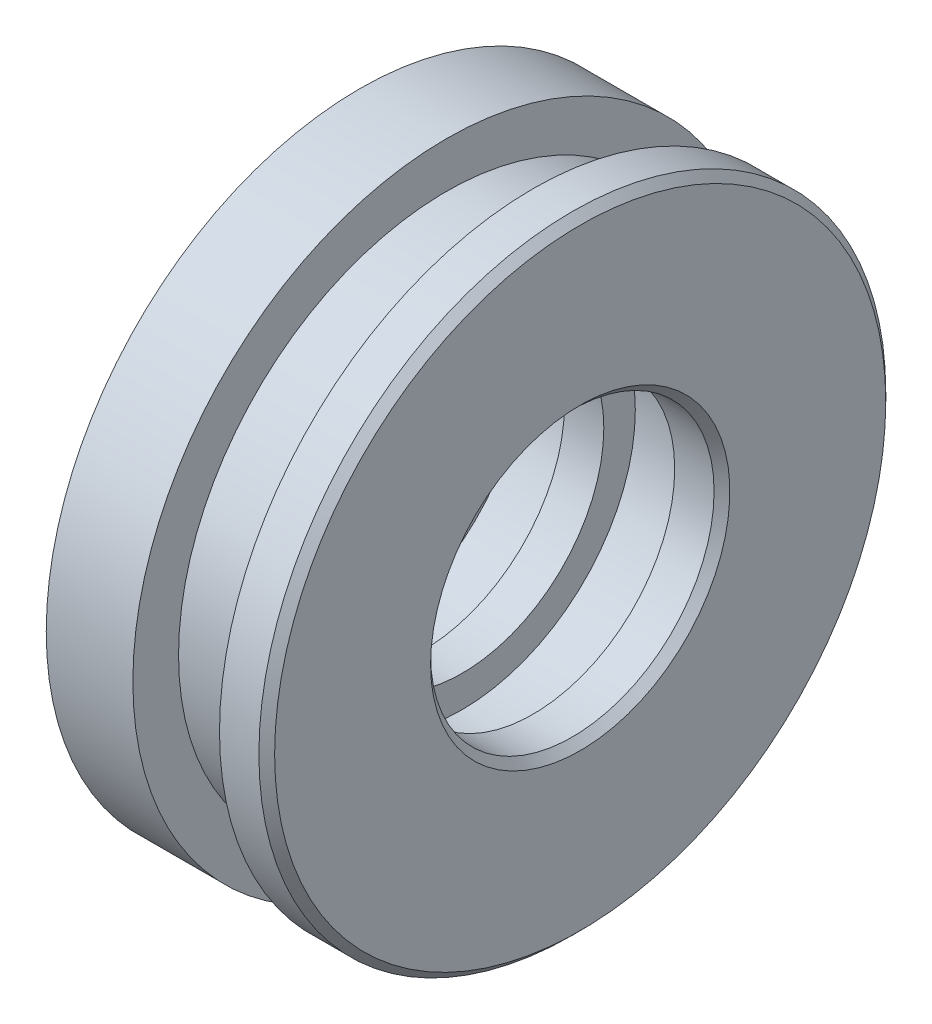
ISO-10303-21;
HEADER;
FILE_DESCRIPTION(('STEP AP214'),'2;1');
FILE_NAME('part.step','',(''),(''),'','','');
FILE_SCHEMA(('AUTOMOTIVE_DESIGN { 1 0 10303 214 1 1 1 1 }'));
ENDSEC;
DATA;
#1=APPLICATION_CONTEXT('core data for automotive mechanical design processes');
#2=APPLICATION_PROTOCOL_DEFINITION('international standard','automotive_design',2000,#1);
#3=PRODUCT_CONTEXT('',#1,'mechanical');
#4=PRODUCT('Part','Part','',(#3));
#5=PRODUCT_RELATED_PRODUCT_CATEGORY('part','',(#4));
#6=PRODUCT_DEFINITION_FORMATION('','',#4);
#7=PRODUCT_DEFINITION_CONTEXT('part definition',#1,'design');
#8=PRODUCT_DEFINITION('design','',#6,#7);
#9=PRODUCT_DEFINITION_SHAPE('','',#8);
#10=(LENGTH_UNIT() NAMED_UNIT(*) SI_UNIT(.MILLI.,.METRE.));
#11=(NAMED_UNIT(*) PLANE_ANGLE_UNIT() SI_UNIT($,.RADIAN.));
#12=(NAMED_UNIT(*) SI_UNIT($,.STERADIAN.) SOLID_ANGLE_UNIT());
#13=UNCERTAINTY_MEASURE_WITH_UNIT(LENGTH_MEASURE(1.E-05),#10,'distance_accuracy_value','');
#14=(GEOMETRIC_REPRESENTATION_CONTEXT(3) GLOBAL_UNCERTAINTY_ASSIGNED_CONTEXT((#13)) GLOBAL_UNIT_ASSIGNED_CONTEXT((#10,
#11,#12)) REPRESENTATION_CONTEXT('',''));
#15=CARTESIAN_POINT('',(0.,0.,0.));
#16=DIRECTION('',(0.,0.,1.));
#17=DIRECTION('',(1.,0.,0.));
#18=AXIS2_PLACEMENT_3D('',#15,#16,#17);
#19=CARTESIAN_POINT('',(0.,0.,0.));
#20=DIRECTION('',(-1.,0.,0.));
#21=DIRECTION('',(0.,0.,1.));
#22=AXIS2_PLACEMENT_3D('',#19,#20,#21);
#23=CYLINDRICAL_SURFACE('',#22,13.);
#24=CARTESIAN_POINT('',(0.,0.,0.));
#25=DIRECTION('',(-1.,0.,0.));
#26=DIRECTION('',(0.,0.,1.));
#27=AXIS2_PLACEMENT_3D('',#24,#25,#26);
#28=CIRCLE('',#27,13.);
#29=CARTESIAN_POINT('',(0.,0.,13.));
#30=VERTEX_POINT('',#29);
#31=EDGE_CURVE('E10',#30,#30,#28,.T.);
#32=ORIENTED_EDGE('',*,*,#31,.F.);
#33=EDGE_LOOP('',(#32));
#34=FACE_BOUND('',#33,.T.);
#35=CARTESIAN_POINT('',(4.,0.,0.));
#36=DIRECTION('',(-1.,0.,0.));
#37=DIRECTION('',(0.,0.,1.));
#38=AXIS2_PLACEMENT_3D('',#35,#36,#37);
#39=CIRCLE('',#38,13.);
#40=CARTESIAN_POINT('',(4.,0.,13.));
#41=VERTEX_POINT('',#40);
#42=EDGE_CURVE('E94',#41,#41,#39,.T.);
#43=ORIENTED_EDGE('',*,*,#42,.T.);
#44=EDGE_LOOP('',(#43));
#45=FACE_BOUND('',#44,.T.);
#46=ADVANCED_FACE('F30',(#34,#45),#23,.T.);
#47=CARTESIAN_POINT('',(0.,8.99999999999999,0.));
#48=DIRECTION('',(1.,0.,0.));
#49=DIRECTION('',(0.,0.,-1.));
#50=AXIS2_PLACEMENT_3D('',#47,#48,#49);
#51=PLANE('',#50);
#52=CARTESIAN_POINT('',(0.,0.,0.));
#53=DIRECTION('',(-1.,0.,0.));
#54=DIRECTION('',(0.,0.,1.));
#55=AXIS2_PLACEMENT_3D('',#52,#53,#54);
#56=CIRCLE('',#55,9.);
#57=CARTESIAN_POINT('',(0.,0.,8.99999999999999));
#58=VERTEX_POINT('',#57);
#59=EDGE_CURVE('E36',#58,#58,#56,.T.);
#60=ORIENTED_EDGE('',*,*,#59,.F.);
#61=EDGE_LOOP('',(#60));
#62=FACE_BOUND('',#61,.T.);
#63=ORIENTED_EDGE('',*,*,#31,.T.);
#64=EDGE_LOOP('',(#63));
#65=FACE_BOUND('',#64,.T.);
#66=ADVANCED_FACE('F203',(#62,#65),#51,.F.);
#67=CARTESIAN_POINT('',(0.,0.,0.));
#68=DIRECTION('',(-1.,0.,0.));
#69=DIRECTION('',(0.,0.,1.));
#70=AXIS2_PLACEMENT_3D('',#67,#68,#69);
#71=CYLINDRICAL_SURFACE('',#70,9.);
#72=CARTESIAN_POINT('',(4.,0.,0.));
#73=DIRECTION('',(-1.,0.,0.));
#74=DIRECTION('',(0.,0.,1.));
#75=AXIS2_PLACEMENT_3D('',#72,#73,#74);
#76=CIRCLE('',#75,9.);
#77=CARTESIAN_POINT('',(4.,0.,8.99999999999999));
#78=VERTEX_POINT('',#77);
#79=EDGE_CURVE('E40',#78,#78,#76,.T.);
#80=ORIENTED_EDGE('',*,*,#79,.F.);
#81=EDGE_LOOP('',(#80));
#82=FACE_BOUND('',#81,.T.);
#83=ORIENTED_EDGE('',*,*,#59,.T.);
#84=EDGE_LOOP('',(#83));
#85=FACE_BOUND('',#84,.T.);
#86=ADVANCED_FACE('F198',(#82,#85),#71,.F.);
#87=CARTESIAN_POINT('',(4.,10.5,0.));
#88=DIRECTION('',(-1.,0.,0.));
#89=DIRECTION('',(0.,0.,1.));
#90=AXIS2_PLACEMENT_3D('',#87,#88,#89);
#91=PLANE('',#90);
#92=CARTESIAN_POINT('',(4.,0.,0.));
#93=DIRECTION('',(-1.,0.,0.));
#94=DIRECTION('',(0.,0.,1.));
#95=AXIS2_PLACEMENT_3D('',#92,#93,#94);
#96=CIRCLE('',#95,10.5);
#97=CARTESIAN_POINT('',(4.,0.,10.5));
#98=VERTEX_POINT('',#97);
#99=EDGE_CURVE('E44',#98,#98,#96,.T.);
#100=ORIENTED_EDGE('',*,*,#99,.F.);
#101=EDGE_LOOP('',(#100));
#102=FACE_BOUND('',#101,.T.);
#103=ORIENTED_EDGE('',*,*,#79,.T.);
#104=EDGE_LOOP('',(#103));
#105=FACE_BOUND('',#104,.T.);
#106=ADVANCED_FACE('F192',(#102,#105),#91,.F.);
#107=CARTESIAN_POINT('',(0.,0.,0.));
#108=DIRECTION('',(-1.,0.,0.));
#109=DIRECTION('',(0.,0.,1.));
#110=AXIS2_PLACEMENT_3D('',#107,#108,#109);
#111=CYLINDRICAL_SURFACE('',#110,10.5);
#112=CARTESIAN_POINT('',(8.,0.,0.));
#113=DIRECTION('',(-1.,0.,0.));
#114=DIRECTION('',(0.,0.,1.));
#115=AXIS2_PLACEMENT_3D('',#112,#113,#114);
#116=CIRCLE('',#115,10.5);
#117=CARTESIAN_POINT('',(8.,0.,10.5));
#118=VERTEX_POINT('',#117);
#119=EDGE_CURVE('E49',#118,#118,#116,.T.);
#120=ORIENTED_EDGE('',*,*,#119,.F.);
#121=EDGE_LOOP('',(#120));
#122=FACE_BOUND('',#121,.T.);
#123=ORIENTED_EDGE('',*,*,#99,.T.);
#124=EDGE_LOOP('',(#123));
#125=FACE_BOUND('',#124,.T.);
#126=ADVANCED_FACE('F186',(#122,#125),#111,.F.);
#127=CARTESIAN_POINT('',(8.,8.99999999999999,0.));
#128=DIRECTION('',(1.,0.,0.));
#129=DIRECTION('',(0.,0.,-1.));
#130=AXIS2_PLACEMENT_3D('',#127,#128,#129);
#131=PLANE('',#130);
#132=CARTESIAN_POINT('',(8.,0.,0.));
#133=DIRECTION('',(-1.,0.,0.));
#134=DIRECTION('',(0.,0.,1.));
#135=AXIS2_PLACEMENT_3D('',#132,#133,#134);
#136=CIRCLE('',#135,9.);
#137=CARTESIAN_POINT('',(8.,0.,9.));
#138=VERTEX_POINT('',#137);
#139=EDGE_CURVE('E52',#138,#138,#136,.T.);
#140=ORIENTED_EDGE('',*,*,#139,.F.);
#141=EDGE_LOOP('',(#140));
#142=FACE_BOUND('',#141,.T.);
#143=ORIENTED_EDGE('',*,*,#119,.T.);
#144=EDGE_LOOP('',(#143));
#145=FACE_BOUND('',#144,.T.);
#146=ADVANCED_FACE('F180',(#142,#145),#131,.F.);
#147=CARTESIAN_POINT('',(0.,0.,0.));
#148=DIRECTION('',(-1.,0.,0.));
#149=DIRECTION('',(0.,0.,1.));
#150=AXIS2_PLACEMENT_3D('',#147,#148,#149);
#151=CYLINDRICAL_SURFACE('',#150,9.);
#152=CARTESIAN_POINT('',(10.5,0.,0.));
#153=DIRECTION('',(-1.,0.,0.));
#154=DIRECTION('',(0.,0.,1.));
#155=AXIS2_PLACEMENT_3D('',#152,#153,#154);
#156=CIRCLE('',#155,9.);
#157=CARTESIAN_POINT('',(10.5,0.,9.));
#158=VERTEX_POINT('',#157);
#159=EDGE_CURVE('E55',#158,#158,#156,.T.);
#160=ORIENTED_EDGE('',*,*,#159,.F.);
#161=EDGE_LOOP('',(#160));
#162=FACE_BOUND('',#161,.T.);
#163=ORIENTED_EDGE('',*,*,#139,.T.);
#164=EDGE_LOOP('',(#163));
#165=FACE_BOUND('',#164,.T.);
#166=ADVANCED_FACE('F174',(#162,#165),#151,.F.);
#167=CARTESIAN_POINT('',(10.5,11.,0.));
#168=DIRECTION('',(-1.,0.,0.));
#169=DIRECTION('',(0.,0.,1.));
#170=AXIS2_PLACEMENT_3D('',#167,#168,#169);
#171=PLANE('',#170);
#172=CARTESIAN_POINT('',(10.5,0.,0.));
#173=DIRECTION('',(-1.,0.,0.));
#174=DIRECTION('',(0.,0.,1.));
#175=AXIS2_PLACEMENT_3D('',#172,#173,#174);
#176=CIRCLE('',#175,11.);
#177=CARTESIAN_POINT('',(10.5,0.,11.));
#178=VERTEX_POINT('',#177);
#179=EDGE_CURVE('E58',#178,#178,#176,.T.);
#180=ORIENTED_EDGE('',*,*,#179,.F.);
#181=EDGE_LOOP('',(#180));
#182=FACE_BOUND('',#181,.T.);
#183=ORIENTED_EDGE('',*,*,#159,.T.);
#184=EDGE_LOOP('',(#183));
#185=FACE_BOUND('',#184,.T.);
#186=ADVANCED_FACE('F168',(#182,#185),#171,.F.);
#187=CARTESIAN_POINT('',(0.,0.,0.));
#188=DIRECTION('',(-1.,0.,0.));
#189=DIRECTION('',(0.,0.,1.));
#190=AXIS2_PLACEMENT_3D('',#187,#188,#189);
#191=CYLINDRICAL_SURFACE('',#190,11.);
#192=CARTESIAN_POINT('',(15.,0.,0.));
#193=DIRECTION('',(-1.,0.,0.));
#194=DIRECTION('',(0.,0.,1.));
#195=AXIS2_PLACEMENT_3D('',#192,#193,#194);
#196=CIRCLE('',#195,11.);
#197=CARTESIAN_POINT('',(15.,0.,11.));
#198=VERTEX_POINT('',#197);
#199=EDGE_CURVE('E61',#198,#198,#196,.T.);
#200=ORIENTED_EDGE('',*,*,#199,.F.);
#201=EDGE_LOOP('',(#200));
#202=FACE_BOUND('',#201,.T.);
#203=ORIENTED_EDGE('',*,*,#179,.T.);
#204=EDGE_LOOP('',(#203));
#205=FACE_BOUND('',#204,.T.);
#206=ADVANCED_FACE('F162',(#202,#205),#191,.F.);
#207=CARTESIAN_POINT('',(15.,9.,0.));
#208=DIRECTION('',(1.,0.,0.));
#209=DIRECTION('',(0.,0.,-1.));
#210=AXIS2_PLACEMENT_3D('',#207,#208,#209);
#211=PLANE('',#210);
#212=CARTESIAN_POINT('',(15.,0.,0.));
#213=DIRECTION('',(-1.,0.,0.));
#214=DIRECTION('',(0.,0.,1.));
#215=AXIS2_PLACEMENT_3D('',#212,#213,#214);
#216=CIRCLE('',#215,9.);
#217=CARTESIAN_POINT('',(15.,0.,9.));
#218=VERTEX_POINT('',#217);
#219=EDGE_CURVE('E64',#218,#218,#216,.T.);
#220=ORIENTED_EDGE('',*,*,#219,.F.);
#221=EDGE_LOOP('',(#220));
#222=FACE_BOUND('',#221,.T.);
#223=ORIENTED_EDGE('',*,*,#199,.T.);
#224=EDGE_LOOP('',(#223));
#225=FACE_BOUND('',#224,.T.);
#226=ADVANCED_FACE('F156',(#222,#225),#211,.F.);
#227=CARTESIAN_POINT('',(0.,0.,0.));
#228=DIRECTION('',(-1.,0.,0.));
#229=DIRECTION('',(0.,0.,1.));
#230=AXIS2_PLACEMENT_3D('',#227,#228,#229);
#231=CYLINDRICAL_SURFACE('',#230,9.);
#232=CARTESIAN_POINT('',(17.5,0.,0.));
#233=DIRECTION('',(-1.,0.,0.));
#234=DIRECTION('',(0.,0.,1.));
#235=AXIS2_PLACEMENT_3D('',#232,#233,#234);
#236=CIRCLE('',#235,9.);
#237=CARTESIAN_POINT('',(17.5,0.,9.));
#238=VERTEX_POINT('',#237);
#239=EDGE_CURVE('E67',#238,#238,#236,.T.);
#240=ORIENTED_EDGE('',*,*,#239,.F.);
#241=EDGE_LOOP('',(#240));
#242=FACE_BOUND('',#241,.T.);
#243=ORIENTED_EDGE('',*,*,#219,.T.);
#244=EDGE_LOOP('',(#243));
#245=FACE_BOUND('',#244,.T.);
#246=ADVANCED_FACE('F150',(#242,#245),#231,.F.);
#247=CARTESIAN_POINT('',(17.5,0.,0.));
#248=DIRECTION('',(1.,0.,0.));
#249=DIRECTION('',(0.,0.,-1.));
#250=AXIS2_PLACEMENT_3D('',#247,#248,#249);
#251=CONICAL_SURFACE('',#250,9.,0.785398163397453);
#252=CARTESIAN_POINT('',(18.,0.,0.));
#253=DIRECTION('',(-1.,0.,0.));
#254=DIRECTION('',(0.,0.,1.));
#255=AXIS2_PLACEMENT_3D('',#252,#253,#254);
#256=CIRCLE('',#255,9.5);
#257=CARTESIAN_POINT('',(18.,0.,9.5));
#258=VERTEX_POINT('',#257);
#259=EDGE_CURVE('E70',#258,#258,#256,.T.);
#260=ORIENTED_EDGE('',*,*,#259,.F.);
#261=EDGE_LOOP('',(#260));
#262=FACE_BOUND('',#261,.T.);
#263=ORIENTED_EDGE('',*,*,#239,.T.);
#264=EDGE_LOOP('',(#263));
#265=FACE_BOUND('',#264,.T.);
#266=ADVANCED_FACE('F144',(#262,#265),#251,.F.);
#267=CARTESIAN_POINT('',(18.,19.4,0.));
#268=DIRECTION('',(-1.,0.,0.));
#269=DIRECTION('',(0.,0.,1.));
#270=AXIS2_PLACEMENT_3D('',#267,#268,#269);
#271=PLANE('',#270);
#272=CARTESIAN_POINT('',(18.,0.,0.));
#273=DIRECTION('',(-1.,0.,0.));
#274=DIRECTION('',(0.,0.,1.));
#275=AXIS2_PLACEMENT_3D('',#272,#273,#274);
#276=CIRCLE('',#275,19.4);
#277=CARTESIAN_POINT('',(18.,0.,19.4));
#278=VERTEX_POINT('',#277);
#279=EDGE_CURVE('E73',#278,#278,#276,.T.);
#280=ORIENTED_EDGE('',*,*,#279,.F.);
#281=EDGE_LOOP('',(#280));
#282=FACE_BOUND('',#281,.T.);
#283=ORIENTED_EDGE('',*,*,#259,.T.);
#284=EDGE_LOOP('',(#283));
#285=FACE_BOUND('',#284,.T.);
#286=ADVANCED_FACE('F138',(#282,#285),#271,.F.);
#287=CARTESIAN_POINT('',(18.,0.,0.));
#288=DIRECTION('',(-1.,0.,0.));
#289=DIRECTION('',(0.,0.,1.));
#290=AXIS2_PLACEMENT_3D('',#287,#288,#289);
#291=CONICAL_SURFACE('',#290,19.4,0.785398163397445);
#292=CARTESIAN_POINT('',(17.5,0.,0.));
#293=DIRECTION('',(-1.,0.,0.));
#294=DIRECTION('',(0.,0.,1.));
#295=AXIS2_PLACEMENT_3D('',#292,#293,#294);
#296=CIRCLE('',#295,19.9);
#297=CARTESIAN_POINT('',(17.5,0.,19.9));
#298=VERTEX_POINT('',#297);
#299=EDGE_CURVE('E76',#298,#298,#296,.T.);
#300=ORIENTED_EDGE('',*,*,#299,.F.);
#301=EDGE_LOOP('',(#300));
#302=FACE_BOUND('',#301,.T.);
#303=ORIENTED_EDGE('',*,*,#279,.T.);
#304=EDGE_LOOP('',(#303));
#305=FACE_BOUND('',#304,.T.);
#306=ADVANCED_FACE('F132',(#302,#305),#291,.T.);
#307=CARTESIAN_POINT('',(0.,0.,0.));
#308=DIRECTION('',(-1.,0.,0.));
#309=DIRECTION('',(0.,0.,1.));
#310=AXIS2_PLACEMENT_3D('',#307,#308,#309);
#311=CYLINDRICAL_SURFACE('',#310,19.9);
#312=CARTESIAN_POINT('',(15.,0.,0.));
#313=DIRECTION('',(-1.,0.,0.));
#314=DIRECTION('',(0.,0.,1.));
#315=AXIS2_PLACEMENT_3D('',#312,#313,#314);
#316=CIRCLE('',#315,19.9);
#317=CARTESIAN_POINT('',(15.,0.,19.9));
#318=VERTEX_POINT('',#317);
#319=EDGE_CURVE('E79',#318,#318,#316,.T.);
#320=ORIENTED_EDGE('',*,*,#319,.F.);
#321=EDGE_LOOP('',(#320));
#322=FACE_BOUND('',#321,.T.);
#323=ORIENTED_EDGE('',*,*,#299,.T.);
#324=EDGE_LOOP('',(#323));
#325=FACE_BOUND('',#324,.T.);
#326=ADVANCED_FACE('F126',(#322,#325),#311,.T.);
#327=CARTESIAN_POINT('',(15.,17.,0.));
#328=DIRECTION('',(1.,0.,0.));
#329=DIRECTION('',(0.,0.,-1.));
#330=AXIS2_PLACEMENT_3D('',#327,#328,#329);
#331=PLANE('',#330);
#332=CARTESIAN_POINT('',(15.,0.,0.));
#333=DIRECTION('',(-1.,0.,0.));
#334=DIRECTION('',(0.,0.,1.));
#335=AXIS2_PLACEMENT_3D('',#332,#333,#334);
#336=CIRCLE('',#335,17.);
#337=CARTESIAN_POINT('',(15.,0.,17.));
#338=VERTEX_POINT('',#337);
#339=EDGE_CURVE('E82',#338,#338,#336,.T.);
#340=ORIENTED_EDGE('',*,*,#339,.F.);
#341=EDGE_LOOP('',(#340));
#342=FACE_BOUND('',#341,.T.);
#343=ORIENTED_EDGE('',*,*,#319,.T.);
#344=EDGE_LOOP('',(#343));
#345=FACE_BOUND('',#344,.T.);
#346=ADVANCED_FACE('F120',(#342,#345),#331,.F.);
#347=CARTESIAN_POINT('',(0.,0.,0.));
#348=DIRECTION('',(-1.,0.,0.));
#349=DIRECTION('',(0.,0.,1.));
#350=AXIS2_PLACEMENT_3D('',#347,#348,#349);
#351=CYLINDRICAL_SURFACE('',#350,17.);
#352=CARTESIAN_POINT('',(9.5,0.,0.));
#353=DIRECTION('',(-1.,0.,0.));
#354=DIRECTION('',(0.,0.,1.));
#355=AXIS2_PLACEMENT_3D('',#352,#353,#354);
#356=CIRCLE('',#355,17.);
#357=CARTESIAN_POINT('',(9.5,0.,17.));
#358=VERTEX_POINT('',#357);
#359=EDGE_CURVE('E85',#358,#358,#356,.T.);
#360=ORIENTED_EDGE('',*,*,#359,.F.);
#361=EDGE_LOOP('',(#360));
#362=FACE_BOUND('',#361,.T.);
#363=ORIENTED_EDGE('',*,*,#339,.T.);
#364=EDGE_LOOP('',(#363));
#365=FACE_BOUND('',#364,.T.);
#366=ADVANCED_FACE('F114',(#362,#365),#351,.T.);
#367=CARTESIAN_POINT('',(9.5,19.9,0.));
#368=DIRECTION('',(-1.,0.,0.));
#369=DIRECTION('',(0.,0.,1.));
#370=AXIS2_PLACEMENT_3D('',#367,#368,#369);
#371=PLANE('',#370);
#372=CARTESIAN_POINT('',(9.5,0.,0.));
#373=DIRECTION('',(-1.,0.,0.));
#374=DIRECTION('',(0.,0.,1.));
#375=AXIS2_PLACEMENT_3D('',#372,#373,#374);
#376=CIRCLE('',#375,19.9);
#377=CARTESIAN_POINT('',(9.5,0.,19.9));
#378=VERTEX_POINT('',#377);
#379=EDGE_CURVE('E88',#378,#378,#376,.T.);
#380=ORIENTED_EDGE('',*,*,#379,.F.);
#381=EDGE_LOOP('',(#380));
#382=FACE_BOUND('',#381,.T.);
#383=ORIENTED_EDGE('',*,*,#359,.T.);
#384=EDGE_LOOP('',(#383));
#385=FACE_BOUND('',#384,.T.);
#386=ADVANCED_FACE('F108',(#382,#385),#371,.F.);
#387=CARTESIAN_POINT('',(0.,0.,0.));
#388=DIRECTION('',(-1.,0.,0.));
#389=DIRECTION('',(0.,0.,1.));
#390=AXIS2_PLACEMENT_3D('',#387,#388,#389);
#391=CYLINDRICAL_SURFACE('',#390,19.9);
#392=CARTESIAN_POINT('',(4.,0.,0.));
#393=DIRECTION('',(-1.,0.,0.));
#394=DIRECTION('',(0.,0.,1.));
#395=AXIS2_PLACEMENT_3D('',#392,#393,#394);
#396=CIRCLE('',#395,19.9);
#397=CARTESIAN_POINT('',(4.,0.,19.9));
#398=VERTEX_POINT('',#397);
#399=EDGE_CURVE('E91',#398,#398,#396,.T.);
#400=ORIENTED_EDGE('',*,*,#399,.F.);
#401=EDGE_LOOP('',(#400));
#402=FACE_BOUND('',#401,.T.);
#403=ORIENTED_EDGE('',*,*,#379,.T.);
#404=EDGE_LOOP('',(#403));
#405=FACE_BOUND('',#404,.T.);
#406=ADVANCED_FACE('F102',(#402,#405),#391,.T.);
#407=CARTESIAN_POINT('',(4.,13.,0.));
#408=DIRECTION('',(1.,0.,0.));
#409=DIRECTION('',(0.,0.,-1.));
#410=AXIS2_PLACEMENT_3D('',#407,#408,#409);
#411=PLANE('',#410);
#412=ORIENTED_EDGE('',*,*,#42,.F.);
#413=EDGE_LOOP('',(#412));
#414=FACE_BOUND('',#413,.T.);
#415=ORIENTED_EDGE('',*,*,#399,.T.);
#416=EDGE_LOOP('',(#415));
#417=FACE_BOUND('',#416,.T.);
#418=ADVANCED_FACE('F99',(#414,#417),#411,.F.);
#419=CLOSED_SHELL('',(#46,#66,#86,#106,#126,#146,#166,#186,#206,#226,#246,#266,#286,#306,#326,
#346,#366,#386,#406,#418));
#420=MANIFOLD_SOLID_BREP('B2',#419);
#421=ADVANCED_BREP_SHAPE_REPRESENTATION('',(#18,#420),#14);
#422=SHAPE_DEFINITION_REPRESENTATION(#9,#421);
ENDSEC;
END-ISO-10303-21;
